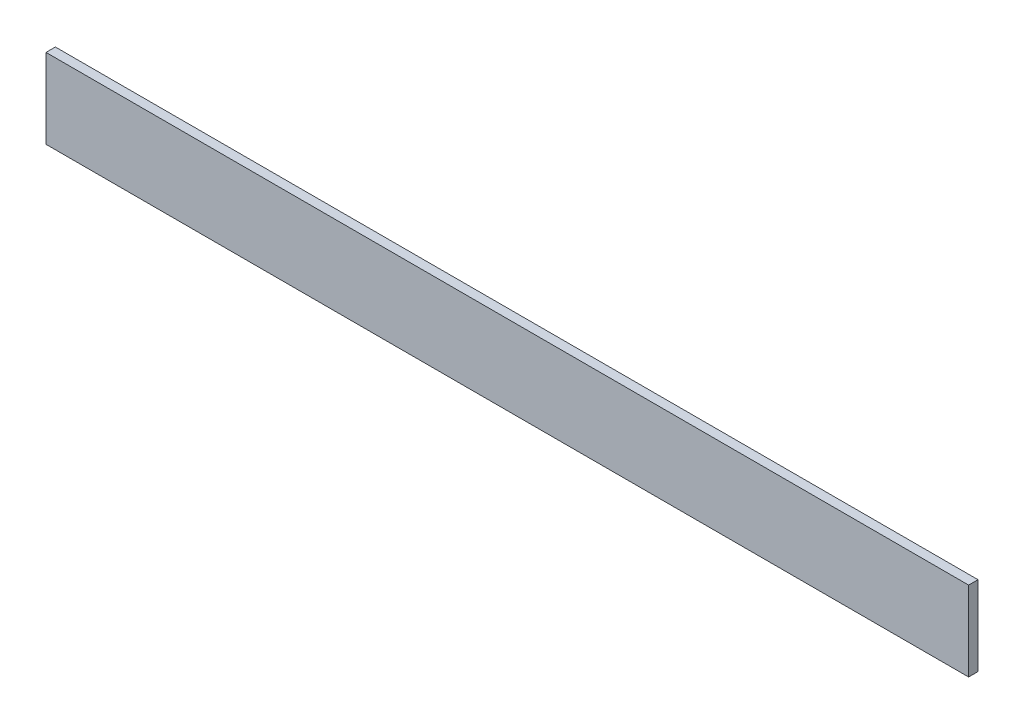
ISO-10303-21;
HEADER;
FILE_DESCRIPTION(('STEP AP214'),'2;1');
FILE_NAME('part.step','',(''),(''),'','','');
FILE_SCHEMA(('AUTOMOTIVE_DESIGN { 1 0 10303 214 1 1 1 1 }'));
ENDSEC;
DATA;
#1=APPLICATION_CONTEXT('core data for automotive mechanical design processes');
#2=APPLICATION_PROTOCOL_DEFINITION('international standard','automotive_design',2000,#1);
#3=PRODUCT_CONTEXT('',#1,'mechanical');
#4=PRODUCT('Part','Part','',(#3));
#5=PRODUCT_RELATED_PRODUCT_CATEGORY('part','',(#4));
#6=PRODUCT_DEFINITION_FORMATION('','',#4);
#7=PRODUCT_DEFINITION_CONTEXT('part definition',#1,'design');
#8=PRODUCT_DEFINITION('design','',#6,#7);
#9=PRODUCT_DEFINITION_SHAPE('','',#8);
#10=(LENGTH_UNIT() NAMED_UNIT(*) SI_UNIT(.MILLI.,.METRE.));
#11=(NAMED_UNIT(*) PLANE_ANGLE_UNIT() SI_UNIT($,.RADIAN.));
#12=(NAMED_UNIT(*) SI_UNIT($,.STERADIAN.) SOLID_ANGLE_UNIT());
#13=UNCERTAINTY_MEASURE_WITH_UNIT(LENGTH_MEASURE(1.E-05),#10,'distance_accuracy_value','');
#14=(GEOMETRIC_REPRESENTATION_CONTEXT(3) GLOBAL_UNCERTAINTY_ASSIGNED_CONTEXT((#13)) GLOBAL_UNIT_ASSIGNED_CONTEXT((#10,
#11,#12)) REPRESENTATION_CONTEXT('',''));
#15=CARTESIAN_POINT('',(0.,0.,0.));
#16=DIRECTION('',(0.,0.,1.));
#17=DIRECTION('',(1.,0.,0.));
#18=AXIS2_PLACEMENT_3D('',#15,#16,#17);
#19=CARTESIAN_POINT('',(240.,-1.19784613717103,30.7086628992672));
#20=DIRECTION('',(1.,0.,0.));
#21=DIRECTION('',(0.,0.,-1.));
#22=AXIS2_PLACEMENT_3D('',#19,#20,#21);
#23=PLANE('',#22);
#24=DIRECTION('',(0.,1.,0.));
#25=VECTOR('',#24,1.);
#26=CARTESIAN_POINT('',(240.,-1.19784613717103,29.7086628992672));
#27=LINE('',#26,#25);
#28=CARTESIAN_POINT('',(240.,7.30215386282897,29.7086628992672));
#29=VERTEX_POINT('',#28);
#30=CARTESIAN_POINT('',(240.,-9.69784613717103,29.7086628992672));
#31=VERTEX_POINT('',#30);
#32=EDGE_CURVE('E55',#29,#31,#27,.F.);
#33=ORIENTED_EDGE('',*,*,#32,.T.);
#34=DIRECTION('',(0.,0.,1.));
#35=VECTOR('',#34,1.);
#36=CARTESIAN_POINT('',(240.,-9.69784613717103,30.7086628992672));
#37=LINE('',#36,#35);
#38=CARTESIAN_POINT('',(240.,-9.69784613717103,31.7086628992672));
#39=VERTEX_POINT('',#38);
#40=EDGE_CURVE('E65',#31,#39,#37,.T.);
#41=ORIENTED_EDGE('',*,*,#40,.T.);
#42=DIRECTION('',(0.,1.,0.));
#43=VECTOR('',#42,1.);
#44=CARTESIAN_POINT('',(240.,-1.19784613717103,31.7086628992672));
#45=LINE('',#44,#43);
#46=CARTESIAN_POINT('',(240.,7.30215386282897,31.7086628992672));
#47=VERTEX_POINT('',#46);
#48=EDGE_CURVE('E62',#39,#47,#45,.T.);
#49=ORIENTED_EDGE('',*,*,#48,.T.);
#50=DIRECTION('',(0.,0.,-1.));
#51=VECTOR('',#50,1.);
#52=CARTESIAN_POINT('',(240.,7.30215386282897,30.7086628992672));
#53=LINE('',#52,#51);
#54=EDGE_CURVE('E64',#47,#29,#53,.T.);
#55=ORIENTED_EDGE('',*,*,#54,.T.);
#56=EDGE_LOOP('',(#33,#41,#49,#55));
#57=FACE_BOUND('',#56,.T.);
#58=ADVANCED_FACE('F16',(#57),#23,.F.);
#59=CARTESIAN_POINT('',(338.5,7.30215386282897,30.7086628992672));
#60=DIRECTION('',(0.,-1.,0.));
#61=DIRECTION('',(0.,0.,-1.));
#62=AXIS2_PLACEMENT_3D('',#59,#60,#61);
#63=PLANE('',#62);
#64=ORIENTED_EDGE('',*,*,#54,.F.);
#65=DIRECTION('',(-1.,0.,0.));
#66=VECTOR('',#65,1.);
#67=CARTESIAN_POINT('',(338.5,7.30215386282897,31.7086628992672));
#68=LINE('',#67,#66);
#69=CARTESIAN_POINT('',(437.,7.30215386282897,31.7086628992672));
#70=VERTEX_POINT('',#69);
#71=EDGE_CURVE('E69',#47,#70,#68,.F.);
#72=ORIENTED_EDGE('',*,*,#71,.T.);
#73=DIRECTION('',(0.,0.,-1.));
#74=VECTOR('',#73,1.);
#75=CARTESIAN_POINT('',(437.,7.30215386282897,30.7086628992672));
#76=LINE('',#75,#74);
#77=CARTESIAN_POINT('',(437.,7.30215386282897,29.7086628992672));
#78=VERTEX_POINT('',#77);
#79=EDGE_CURVE('E20',#78,#70,#76,.F.);
#80=ORIENTED_EDGE('',*,*,#79,.F.);
#81=DIRECTION('',(1.,0.,0.));
#82=VECTOR('',#81,1.);
#83=CARTESIAN_POINT('',(338.5,7.30215386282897,29.7086628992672));
#84=LINE('',#83,#82);
#85=EDGE_CURVE('E73',#78,#29,#84,.F.);
#86=ORIENTED_EDGE('',*,*,#85,.T.);
#87=EDGE_LOOP('',(#64,#72,#80,#86));
#88=FACE_BOUND('',#87,.T.);
#89=ADVANCED_FACE('F71',(#88),#63,.F.);
#90=CARTESIAN_POINT('',(338.5,-1.19784613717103,31.7086628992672));
#91=DIRECTION('',(0.,0.,-1.));
#92=DIRECTION('',(-1.,0.,0.));
#93=AXIS2_PLACEMENT_3D('',#90,#91,#92);
#94=PLANE('',#93);
#95=ORIENTED_EDGE('',*,*,#48,.F.);
#96=DIRECTION('',(1.,0.,0.));
#97=VECTOR('',#96,1.);
#98=CARTESIAN_POINT('',(338.5,-9.69784613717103,31.7086628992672));
#99=LINE('',#98,#97);
#100=CARTESIAN_POINT('',(437.,-9.69784613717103,31.7086628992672));
#101=VERTEX_POINT('',#100);
#102=EDGE_CURVE('E79',#39,#101,#99,.T.);
#103=ORIENTED_EDGE('',*,*,#102,.T.);
#104=DIRECTION('',(0.,1.,0.));
#105=VECTOR('',#104,1.);
#106=CARTESIAN_POINT('',(437.,-1.19784613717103,31.7086628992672));
#107=LINE('',#106,#105);
#108=EDGE_CURVE('E77',#70,#101,#107,.F.);
#109=ORIENTED_EDGE('',*,*,#108,.F.);
#110=ORIENTED_EDGE('',*,*,#71,.F.);
#111=EDGE_LOOP('',(#95,#103,#109,#110));
#112=FACE_BOUND('',#111,.T.);
#113=ADVANCED_FACE('F75',(#112),#94,.F.);
#114=CARTESIAN_POINT('',(338.5,-9.69784613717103,30.7086628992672));
#115=DIRECTION('',(0.,1.,0.));
#116=DIRECTION('',(0.,0.,1.));
#117=AXIS2_PLACEMENT_3D('',#114,#115,#116);
#118=PLANE('',#117);
#119=ORIENTED_EDGE('',*,*,#40,.F.);
#120=DIRECTION('',(1.,0.,0.));
#121=VECTOR('',#120,1.);
#122=CARTESIAN_POINT('',(338.5,-9.69784613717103,29.7086628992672));
#123=LINE('',#122,#121);
#124=CARTESIAN_POINT('',(437.,-9.69784613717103,29.7086628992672));
#125=VERTEX_POINT('',#124);
#126=EDGE_CURVE('E35',#31,#125,#123,.T.);
#127=ORIENTED_EDGE('',*,*,#126,.T.);
#128=DIRECTION('',(0.,0.,-1.));
#129=VECTOR('',#128,1.);
#130=CARTESIAN_POINT('',(437.,-9.69784613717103,30.7086628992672));
#131=LINE('',#130,#129);
#132=EDGE_CURVE('E26',#101,#125,#131,.T.);
#133=ORIENTED_EDGE('',*,*,#132,.F.);
#134=ORIENTED_EDGE('',*,*,#102,.F.);
#135=EDGE_LOOP('',(#119,#127,#133,#134));
#136=FACE_BOUND('',#135,.T.);
#137=ADVANCED_FACE('F91',(#136),#118,.F.);
#138=CARTESIAN_POINT('',(338.5,-1.19784613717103,29.7086628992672));
#139=DIRECTION('',(0.,0.,1.));
#140=DIRECTION('',(1.,0.,0.));
#141=AXIS2_PLACEMENT_3D('',#138,#139,#140);
#142=PLANE('',#141);
#143=ORIENTED_EDGE('',*,*,#32,.F.);
#144=ORIENTED_EDGE('',*,*,#85,.F.);
#145=DIRECTION('',(0.,1.,0.));
#146=VECTOR('',#145,1.);
#147=CARTESIAN_POINT('',(437.,-1.19784613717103,29.7086628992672));
#148=LINE('',#147,#146);
#149=EDGE_CURVE('E11',#125,#78,#148,.T.);
#150=ORIENTED_EDGE('',*,*,#149,.F.);
#151=ORIENTED_EDGE('',*,*,#126,.F.);
#152=EDGE_LOOP('',(#143,#144,#150,#151));
#153=FACE_BOUND('',#152,.T.);
#154=ADVANCED_FACE('F89',(#153),#142,.F.);
#155=CARTESIAN_POINT('',(437.,-1.19784613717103,30.7086628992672));
#156=DIRECTION('',(1.,0.,0.));
#157=DIRECTION('',(0.,0.,-1.));
#158=AXIS2_PLACEMENT_3D('',#155,#156,#157);
#159=PLANE('',#158);
#160=ORIENTED_EDGE('',*,*,#132,.T.);
#161=ORIENTED_EDGE('',*,*,#149,.T.);
#162=ORIENTED_EDGE('',*,*,#79,.T.);
#163=ORIENTED_EDGE('',*,*,#108,.T.);
#164=EDGE_LOOP('',(#160,#161,#162,#163));
#165=FACE_BOUND('',#164,.T.);
#166=ADVANCED_FACE('F18',(#165),#159,.T.);
#167=CLOSED_SHELL('',(#58,#89,#113,#137,#154,#166));
#168=MANIFOLD_SOLID_BREP('B1',#167);
#169=ADVANCED_BREP_SHAPE_REPRESENTATION('',(#18,#168),#14);
#170=SHAPE_DEFINITION_REPRESENTATION(#9,#169);
ENDSEC;
END-ISO-10303-21;
